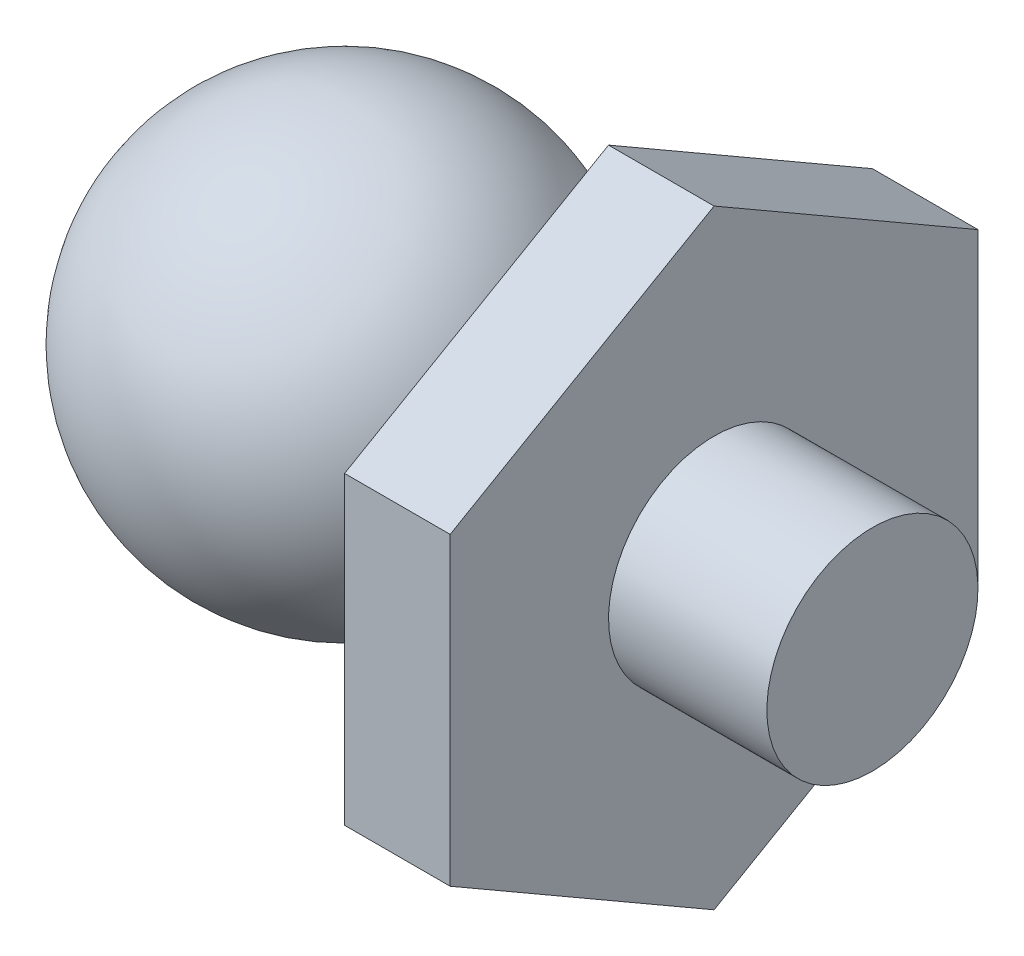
from build123d import *

# Parameters (mm, degrees)
BOSS_EXTRU_1_DEPTH = 1


with BuildPart() as part:
    # Esquisse1 → Base-R_volution (revolve)
    with BuildSketch(Plane.XY, mode=Mode.PRIVATE) as base_r_volution_sk:
        with BuildLine():
            Line((5, 0), (-2, 0))
            ThreePointArc((-2, 0), (-0.51763809, 1.931851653), (1.732050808, 1))
            Line((1.732050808, 1), (5, 1))
            Line((5, 1), (5, 0))
        make_face()
    revolve(base_r_volution_sk.sketch.rotate(Axis((0, 0, 0), (1, 0, 0)), 180), axis=Axis((0, 0, 0), (1, 0, 0)))

    # Esquisse2 → Boss.-Extru.1 (add)
    with BuildSketch(Plane(origin=(3.5, 0, 0), x_dir=(0, 0, -1), z_dir=(1, 0, 0))):
        Polygon((0, -2.886751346), (2.5, -1.443375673), (2.5, 1.443375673), (0, 2.886751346), (-2.5, 1.443375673), (-2.5, -1.443375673), align=None)
    extrude(amount=-BOSS_EXTRU_1_DEPTH)


solid = part.part
